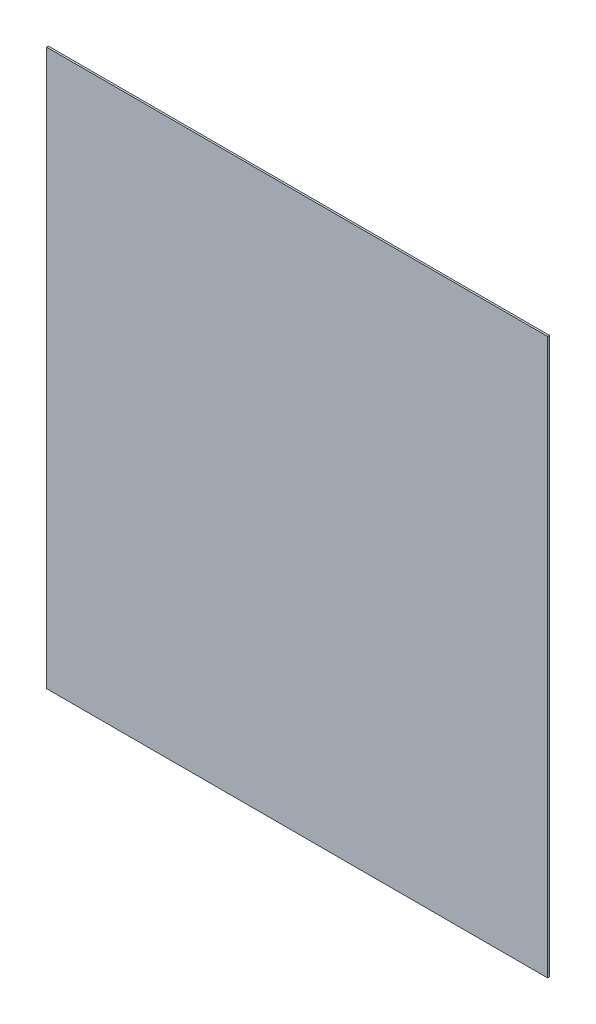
ISO-10303-21;
HEADER;
FILE_DESCRIPTION(('STEP AP214'),'2;1');
FILE_NAME('part.step','',(''),(''),'','','');
FILE_SCHEMA(('AUTOMOTIVE_DESIGN { 1 0 10303 214 1 1 1 1 }'));
ENDSEC;
DATA;
#1=APPLICATION_CONTEXT('core data for automotive mechanical design processes');
#2=APPLICATION_PROTOCOL_DEFINITION('international standard','automotive_design',2000,#1);
#3=PRODUCT_CONTEXT('',#1,'mechanical');
#4=PRODUCT('Part','Part','',(#3));
#5=PRODUCT_RELATED_PRODUCT_CATEGORY('part','',(#4));
#6=PRODUCT_DEFINITION_FORMATION('','',#4);
#7=PRODUCT_DEFINITION_CONTEXT('part definition',#1,'design');
#8=PRODUCT_DEFINITION('design','',#6,#7);
#9=PRODUCT_DEFINITION_SHAPE('','',#8);
#10=(LENGTH_UNIT() NAMED_UNIT(*) SI_UNIT(.MILLI.,.METRE.));
#11=(NAMED_UNIT(*) PLANE_ANGLE_UNIT() SI_UNIT($,.RADIAN.));
#12=(NAMED_UNIT(*) SI_UNIT($,.STERADIAN.) SOLID_ANGLE_UNIT());
#13=UNCERTAINTY_MEASURE_WITH_UNIT(LENGTH_MEASURE(1.E-05),#10,'distance_accuracy_value','');
#14=(GEOMETRIC_REPRESENTATION_CONTEXT(3) GLOBAL_UNCERTAINTY_ASSIGNED_CONTEXT((#13)) GLOBAL_UNIT_ASSIGNED_CONTEXT((#10,
#11,#12)) REPRESENTATION_CONTEXT('',''));
#15=CARTESIAN_POINT('',(0.,0.,0.));
#16=DIRECTION('',(0.,0.,1.));
#17=DIRECTION('',(1.,0.,0.));
#18=AXIS2_PLACEMENT_3D('',#15,#16,#17);
#19=CARTESIAN_POINT('',(-1090.,1208.,4.));
#20=DIRECTION('',(1.,0.,0.));
#21=DIRECTION('',(0.,1.,0.));
#22=AXIS2_PLACEMENT_3D('',#19,#20,#21);
#23=PLANE('',#22);
#24=DIRECTION('',(0.,-1.,0.));
#25=VECTOR('',#24,1.);
#26=CARTESIAN_POINT('',(-1090.,1208.,0.));
#27=LINE('',#26,#25);
#28=CARTESIAN_POINT('',(-1090.,1208.,0.));
#29=VERTEX_POINT('',#28);
#30=CARTESIAN_POINT('',(-1090.,0.,0.));
#31=VERTEX_POINT('',#30);
#32=EDGE_CURVE('E96',#29,#31,#27,.T.);
#33=ORIENTED_EDGE('',*,*,#32,.T.);
#34=DIRECTION('',(0.,0.,-1.));
#35=VECTOR('',#34,1.);
#36=CARTESIAN_POINT('',(-1090.,0.,4.));
#37=LINE('',#36,#35);
#38=CARTESIAN_POINT('',(-1090.,0.,4.));
#39=VERTEX_POINT('',#38);
#40=EDGE_CURVE('E11',#39,#31,#37,.T.);
#41=ORIENTED_EDGE('',*,*,#40,.F.);
#42=DIRECTION('',(0.,-1.,0.));
#43=VECTOR('',#42,1.);
#44=CARTESIAN_POINT('',(-1090.,1208.,4.));
#45=LINE('',#44,#43);
#46=CARTESIAN_POINT('',(-1090.,1208.,4.));
#47=VERTEX_POINT('',#46);
#48=EDGE_CURVE('E84',#47,#39,#45,.T.);
#49=ORIENTED_EDGE('',*,*,#48,.F.);
#50=DIRECTION('',(0.,0.,-1.));
#51=VECTOR('',#50,1.);
#52=CARTESIAN_POINT('',(-1090.,1208.,4.));
#53=LINE('',#52,#51);
#54=EDGE_CURVE('E92',#47,#29,#53,.T.);
#55=ORIENTED_EDGE('',*,*,#54,.T.);
#56=EDGE_LOOP('',(#33,#41,#49,#55));
#57=FACE_BOUND('',#56,.T.);
#58=ADVANCED_FACE('F33',(#57),#23,.F.);
#59=CARTESIAN_POINT('',(-1090.,0.,4.));
#60=DIRECTION('',(0.,1.,0.));
#61=DIRECTION('',(0.,0.,1.));
#62=AXIS2_PLACEMENT_3D('',#59,#60,#61);
#63=PLANE('',#62);
#64=DIRECTION('',(1.,0.,0.));
#65=VECTOR('',#64,1.);
#66=CARTESIAN_POINT('',(-1090.,0.,0.));
#67=LINE('',#66,#65);
#68=CARTESIAN_POINT('',(0.,0.,0.));
#69=VERTEX_POINT('',#68);
#70=EDGE_CURVE('E88',#31,#69,#67,.T.);
#71=ORIENTED_EDGE('',*,*,#70,.T.);
#72=DIRECTION('',(0.,0.,-1.));
#73=VECTOR('',#72,1.);
#74=CARTESIAN_POINT('',(0.,0.,4.));
#75=LINE('',#74,#73);
#76=CARTESIAN_POINT('',(0.,0.,4.));
#77=VERTEX_POINT('',#76);
#78=EDGE_CURVE('E41',#77,#69,#75,.T.);
#79=ORIENTED_EDGE('',*,*,#78,.F.);
#80=DIRECTION('',(1.,0.,0.));
#81=VECTOR('',#80,1.);
#82=CARTESIAN_POINT('',(-1090.,0.,4.));
#83=LINE('',#82,#81);
#84=EDGE_CURVE('E79',#39,#77,#83,.T.);
#85=ORIENTED_EDGE('',*,*,#84,.F.);
#86=ORIENTED_EDGE('',*,*,#40,.T.);
#87=EDGE_LOOP('',(#71,#79,#85,#86));
#88=FACE_BOUND('',#87,.T.);
#89=ADVANCED_FACE('F87',(#88),#63,.F.);
#90=CARTESIAN_POINT('',(0.,1208.,4.));
#91=DIRECTION('',(-1.,0.,0.));
#92=DIRECTION('',(0.,0.,1.));
#93=AXIS2_PLACEMENT_3D('',#90,#91,#92);
#94=PLANE('',#93);
#95=DIRECTION('',(0.,1.,0.));
#96=VECTOR('',#95,1.);
#97=CARTESIAN_POINT('',(0.,1208.,0.));
#98=LINE('',#97,#96);
#99=CARTESIAN_POINT('',(0.,1208.,0.));
#100=VERTEX_POINT('',#99);
#101=EDGE_CURVE('E66',#69,#100,#98,.T.);
#102=ORIENTED_EDGE('',*,*,#101,.T.);
#103=DIRECTION('',(0.,0.,-1.));
#104=VECTOR('',#103,1.);
#105=CARTESIAN_POINT('',(0.,1208.,4.));
#106=LINE('',#105,#104);
#107=CARTESIAN_POINT('',(0.,1208.,4.));
#108=VERTEX_POINT('',#107);
#109=EDGE_CURVE('E89',#108,#100,#106,.T.);
#110=ORIENTED_EDGE('',*,*,#109,.F.);
#111=DIRECTION('',(0.,1.,0.));
#112=VECTOR('',#111,1.);
#113=CARTESIAN_POINT('',(0.,1208.,4.));
#114=LINE('',#113,#112);
#115=EDGE_CURVE('E82',#77,#108,#114,.T.);
#116=ORIENTED_EDGE('',*,*,#115,.F.);
#117=ORIENTED_EDGE('',*,*,#78,.T.);
#118=EDGE_LOOP('',(#102,#110,#116,#117));
#119=FACE_BOUND('',#118,.T.);
#120=ADVANCED_FACE('F90',(#119),#94,.F.);
#121=CARTESIAN_POINT('',(-1090.,1208.,4.));
#122=DIRECTION('',(0.,-1.,0.));
#123=DIRECTION('',(0.,0.,-1.));
#124=AXIS2_PLACEMENT_3D('',#121,#122,#123);
#125=PLANE('',#124);
#126=DIRECTION('',(-1.,0.,0.));
#127=VECTOR('',#126,1.);
#128=CARTESIAN_POINT('',(-1090.,1208.,0.));
#129=LINE('',#128,#127);
#130=EDGE_CURVE('E72',#100,#29,#129,.T.);
#131=ORIENTED_EDGE('',*,*,#130,.T.);
#132=ORIENTED_EDGE('',*,*,#54,.F.);
#133=DIRECTION('',(-1.,0.,0.));
#134=VECTOR('',#133,1.);
#135=CARTESIAN_POINT('',(-1090.,1208.,4.));
#136=LINE('',#135,#134);
#137=EDGE_CURVE('E49',#108,#47,#136,.T.);
#138=ORIENTED_EDGE('',*,*,#137,.F.);
#139=ORIENTED_EDGE('',*,*,#109,.T.);
#140=EDGE_LOOP('',(#131,#132,#138,#139));
#141=FACE_BOUND('',#140,.T.);
#142=ADVANCED_FACE('F103',(#141),#125,.F.);
#143=CARTESIAN_POINT('',(0.,0.,4.));
#144=DIRECTION('',(0.,0.,1.));
#145=DIRECTION('',(1.,0.,0.));
#146=AXIS2_PLACEMENT_3D('',#143,#144,#145);
#147=PLANE('',#146);
#148=ORIENTED_EDGE('',*,*,#48,.T.);
#149=ORIENTED_EDGE('',*,*,#84,.T.);
#150=ORIENTED_EDGE('',*,*,#115,.T.);
#151=ORIENTED_EDGE('',*,*,#137,.T.);
#152=EDGE_LOOP('',(#148,#149,#150,#151));
#153=FACE_BOUND('',#152,.T.);
#154=ADVANCED_FACE('F80',(#153),#147,.T.);
#155=CARTESIAN_POINT('',(0.,0.,0.));
#156=DIRECTION('',(0.,0.,1.));
#157=DIRECTION('',(1.,0.,0.));
#158=AXIS2_PLACEMENT_3D('',#155,#156,#157);
#159=PLANE('',#158);
#160=ORIENTED_EDGE('',*,*,#32,.F.);
#161=ORIENTED_EDGE('',*,*,#130,.F.);
#162=ORIENTED_EDGE('',*,*,#101,.F.);
#163=ORIENTED_EDGE('',*,*,#70,.F.);
#164=EDGE_LOOP('',(#160,#161,#162,#163));
#165=FACE_BOUND('',#164,.T.);
#166=ADVANCED_FACE('F106',(#165),#159,.F.);
#167=CLOSED_SHELL('',(#58,#89,#120,#142,#154,#166));
#168=MANIFOLD_SOLID_BREP('B2',#167);
#169=ADVANCED_BREP_SHAPE_REPRESENTATION('',(#18,#168),#14);
#170=SHAPE_DEFINITION_REPRESENTATION(#9,#169);
ENDSEC;
END-ISO-10303-21;
